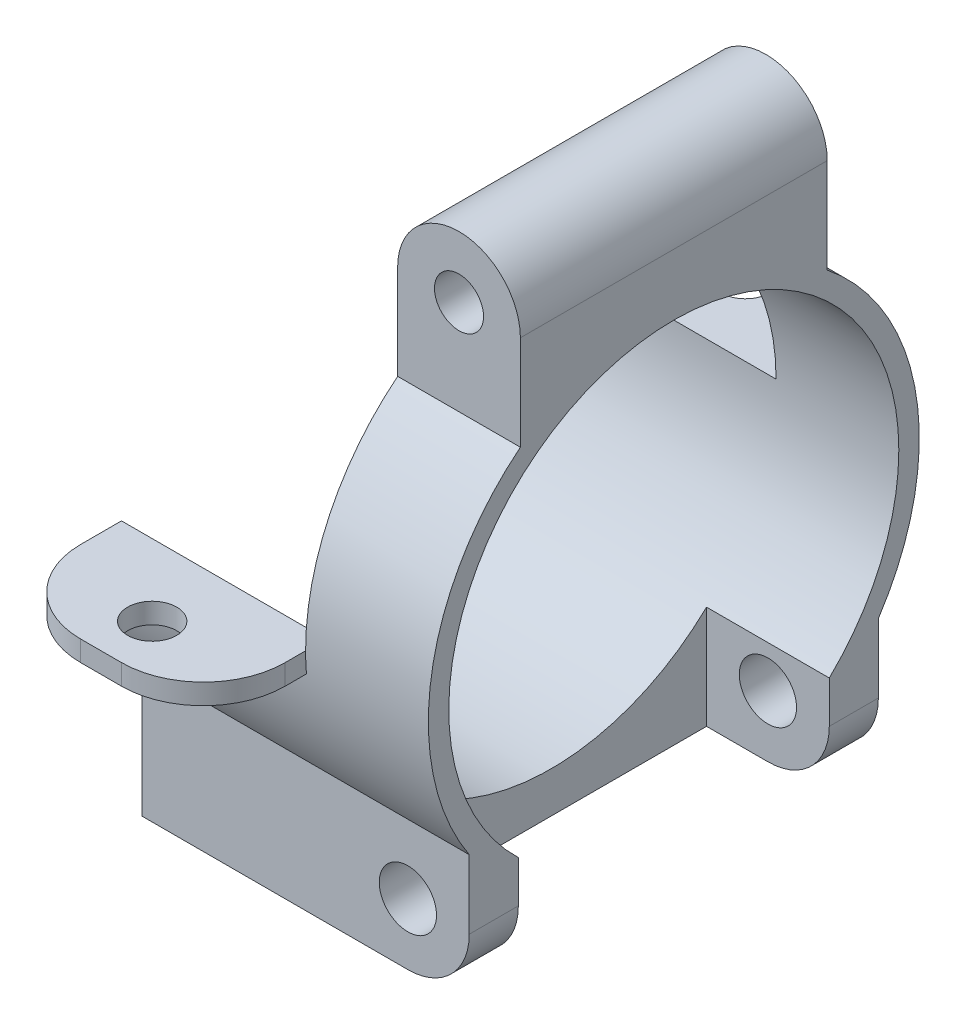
from build123d import *

# Parameters (mm, degrees)
BOSS_EXTRUDE1_DEPTH      = 9.525
SKETCH2_R                = 15.24
BOSS_EXTRUDE2_DEPTH      = 7.62
BOSS_EXTRUDE3_DEPTH      = 12.7
SKETCH5_R                = 13.97
CUT_EXTRUDE1_DEPTH       = 39.290026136
BOSS_EXTRUDE4_DEPTH      = 12.7
BOSS_EXTRUDE4_DEPTH_BACK = 3.81
SKETCH6_R                = 1.778
SKETCH6_R_2              = 1.524
CUT_EXTRUDE3_DEPTH       = 48.21258095
SKETCH8_W                = 19.304
SKETCH8_H                = 12.466672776
CUT_EXTRUDE4_DEPTH       = 7.62
BOSS_EXTRUDE5_DEPTH      = 1.27
SKETCH10_R               = 1.524
CUT_EXTRUDE5_DEPTH       = 35.710751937


with BuildPart() as part:
    # Sketch1 → Boss-Extrude1 (new, symmetric)
    with BuildSketch(Plane.XY):
        with BuildLine():
            Line((-3.81, 0), (-3.81, 30.48))
            ThreePointArc((-3.81, 30.48), (0, 34.29), (3.81, 30.48))
            Line((3.81, 30.48), (3.81, 0))
            ThreePointArc((3.81, 0), (0, -3.81), (-3.81, 0))
        make_face()
    extrude(amount=BOSS_EXTRUDE1_DEPTH, both=True)

    # Sketch2 → Boss-Extrude2 (add)
    with BuildSketch(Plane(origin=(3.81, 0, 0), x_dir=(0, 0, -1), z_dir=(1, 0, 0))):
        with Locations((0, 12.7)):
            Circle(SKETCH2_R)
    extrude(amount=-BOSS_EXTRUDE2_DEPTH)

    # Sketch3 → Boss-Extrude3 (add, symmetric)
    with BuildSketch(Plane.XY):
        with BuildLine():
            Line((-3.81, 0), (-3.81, 12.018655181))
            Line((-3.81, 12.018655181), (3.81, 12.018655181))
            Line((3.81, 12.018655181), (3.81, 0))
            ThreePointArc((3.81, 0), (0, -3.81), (-3.81, 0))
        make_face()
    extrude(amount=BOSS_EXTRUDE3_DEPTH, both=True)

    # Sketch5 → Cut-Extrude1 (cut, through all)
    with BuildSketch(Plane(origin=(3.81, 0, 0), x_dir=(0, 0, -1), z_dir=(1, 0, 0))):
        with Locations((0, 12.7)):
            Circle(SKETCH5_R)
    extrude(amount=-CUT_EXTRUDE1_DEPTH, mode=Mode.SUBTRACT)

    # Sketch7 → Boss-Extrude4 (add, two sides: drawn at the far end of the back side and taken through both)
    with BuildSketch(Plane.ZY.offset(3.81).offset(-BOSS_EXTRUDE4_DEPTH_BACK)):
        with BuildLine():
            Line((-12.7, -3.81), (-12.7, 4.275773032))
            ThreePointArc((-12.7, 4.275773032), (-14.591189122, 8.300590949), (-15.24, 12.7))
            Line((-15.24, 12.7), (-13.97, 12.7))
            ThreePointArc((-13.97, 12.7), (0, -1.27), (13.97, 12.7))
            Line((13.97, 12.7), (15.24, 12.7))
            ThreePointArc((15.24, 12.7), (14.591189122, 8.300590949), (12.7, 4.275773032))
            Line((12.7, 4.275773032), (12.7, -3.81))
            Line((12.7, -3.81), (-12.7, -3.81))
        make_face()
    extrude(amount=BOSS_EXTRUDE4_DEPTH + BOSS_EXTRUDE4_DEPTH_BACK)

    # Sketch6 → Cut-Extrude3 (cut, through all)
    with BuildSketch(Plane.XY.offset(12.7)):
        Circle(SKETCH6_R)
        with Locations((0, 30.48)):
            Circle(SKETCH6_R_2)
    extrude(amount=-CUT_EXTRUDE3_DEPTH, mode=Mode.SUBTRACT)

    # Sketch8 → Cut-Extrude4 (cut)
    with BuildSketch(Plane(origin=(3.81, 0, 0), x_dir=(0, 0, -1), z_dir=(1, 0, 0))):
        with Locations((0, 1.027102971)):
            Rectangle(SKETCH8_W, SKETCH8_H)
    extrude(amount=-CUT_EXTRUDE4_DEPTH, mode=Mode.SUBTRACT)

    # Sketch9 → Boss-Extrude5 (add)
    with BuildSketch(Plane(origin=(0, 12.7, 0), x_dir=(1, 0, 0), z_dir=(0, 1, 0))):
        with BuildLine():
            Line((-3.81, 13.97), (-16.51, 13.97))
            Line((-16.51, 13.97), (-16.51, 16.51))
            ThreePointArc((-16.51, 16.51), (-15.022102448, 20.102102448), (-11.43, 21.59))
            Line((-11.43, 21.59), (-8.89, 21.59))
            ThreePointArc((-8.89, 21.59), (-5.297897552, 20.102102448), (-3.81, 16.51))
            Line((-3.81, 16.51), (-3.81, 13.97))
        make_face()
        with BuildLine():
            Line((-8.89, -21.59), (-11.43, -21.59))
            ThreePointArc((-11.43, -21.59), (-15.022102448, -20.102102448), (-16.51, -16.51))
            Line((-16.51, -16.51), (-16.51, -13.97))
            Line((-16.51, -13.97), (-3.81, -13.97))
            Line((-3.81, -13.97), (-3.81, -16.51))
            ThreePointArc((-3.81, -16.51), (-5.297897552, -20.102102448), (-8.89, -21.59))
        make_face()
    extrude(amount=-BOSS_EXTRUDE5_DEPTH)

    # Sketch10 → Cut-Extrude5 (cut, through all)
    with BuildSketch(Plane(origin=(0, 12.7, 0), x_dir=(1, 0, 0), z_dir=(0, 1, 0))):
        with Locations(Location((-10.16, 18.415, 0), (0, 0, 180))):
            Circle(SKETCH10_R)
        with Locations((-10.16, -18.415)):
            Circle(SKETCH10_R)
    extrude(amount=-CUT_EXTRUDE5_DEPTH, mode=Mode.SUBTRACT)


solid = part.part
